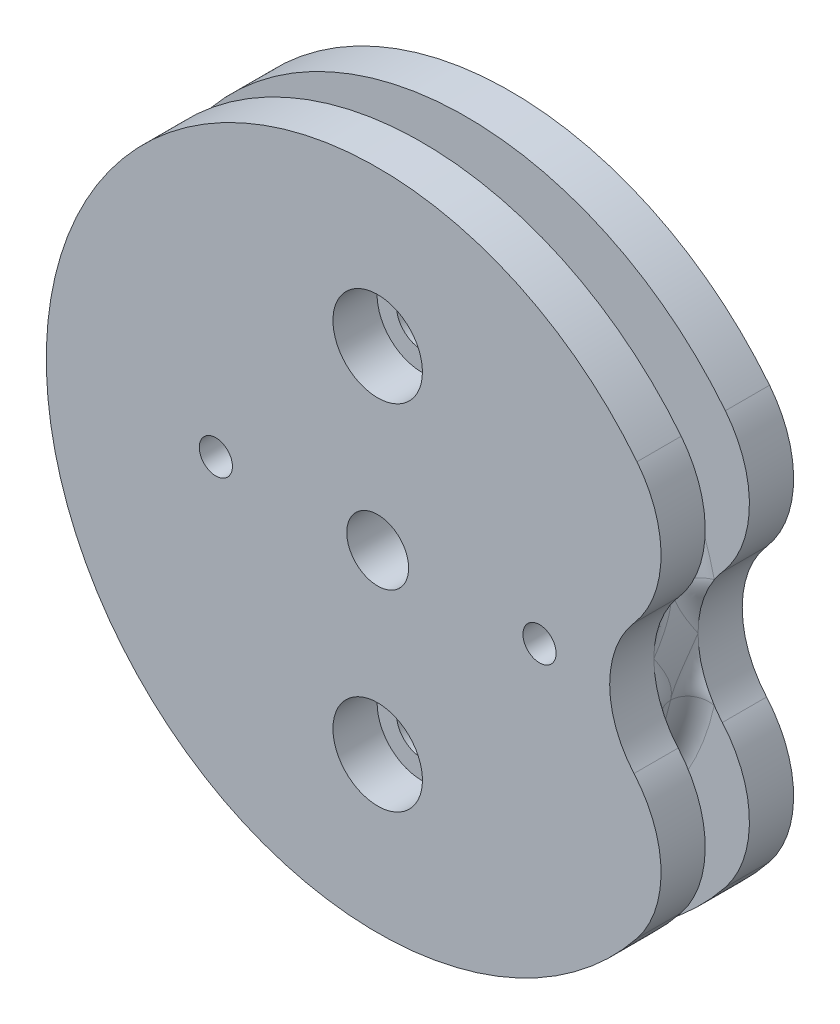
ISO-10303-21;
HEADER;
FILE_DESCRIPTION(('STEP AP214'),'2;1');
FILE_NAME('part.step','',(''),(''),'','','');
FILE_SCHEMA(('AUTOMOTIVE_DESIGN { 1 0 10303 214 1 1 1 1 }'));
ENDSEC;
DATA;
#1=APPLICATION_CONTEXT('core data for automotive mechanical design processes');
#2=APPLICATION_PROTOCOL_DEFINITION('international standard','automotive_design',2000,#1);
#3=PRODUCT_CONTEXT('',#1,'mechanical');
#4=PRODUCT('Part','Part','',(#3));
#5=PRODUCT_RELATED_PRODUCT_CATEGORY('part','',(#4));
#6=PRODUCT_DEFINITION_FORMATION('','',#4);
#7=PRODUCT_DEFINITION_CONTEXT('part definition',#1,'design');
#8=PRODUCT_DEFINITION('design','',#6,#7);
#9=PRODUCT_DEFINITION_SHAPE('','',#8);
#10=(LENGTH_UNIT() NAMED_UNIT(*) SI_UNIT(.MILLI.,.METRE.));
#11=(NAMED_UNIT(*) PLANE_ANGLE_UNIT() SI_UNIT($,.RADIAN.));
#12=(NAMED_UNIT(*) SI_UNIT($,.STERADIAN.) SOLID_ANGLE_UNIT());
#13=UNCERTAINTY_MEASURE_WITH_UNIT(LENGTH_MEASURE(1.E-05),#10,'distance_accuracy_value','');
#14=(GEOMETRIC_REPRESENTATION_CONTEXT(3) GLOBAL_UNCERTAINTY_ASSIGNED_CONTEXT((#13)) GLOBAL_UNIT_ASSIGNED_CONTEXT((#10,
#11,#12)) REPRESENTATION_CONTEXT('',''));
#15=CARTESIAN_POINT('',(0.,0.,0.));
#16=DIRECTION('',(0.,0.,1.));
#17=DIRECTION('',(1.,0.,0.));
#18=AXIS2_PLACEMENT_3D('',#15,#16,#17);
#19=CARTESIAN_POINT('',(0.,0.,3.));
#20=DIRECTION('',(0.,0.,-1.));
#21=DIRECTION('',(-1.,0.,0.));
#22=AXIS2_PLACEMENT_3D('',#19,#20,#21);
#23=CYLINDRICAL_SURFACE('',#22,15.);
#24=CARTESIAN_POINT('',(0.,0.,-1.));
#25=DIRECTION('',(0.,0.,1.));
#26=DIRECTION('',(1.,0.,0.));
#27=AXIS2_PLACEMENT_3D('',#24,#25,#26);
#28=CIRCLE('',#27,15.);
#29=CARTESIAN_POINT('',(11.7375,9.33975876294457,-1.));
#30=VERTEX_POINT('',#29);
#31=CARTESIAN_POINT('',(11.7375,-9.33975876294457,-1.));
#32=VERTEX_POINT('',#31);
#33=EDGE_CURVE('E236',#30,#32,#28,.T.);
#34=ORIENTED_EDGE('',*,*,#33,.F.);
#35=DIRECTION('',(0.,0.,-1.));
#36=VECTOR('',#35,1.);
#37=CARTESIAN_POINT('',(11.7375,9.33975876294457,3.));
#38=LINE('',#37,#36);
#39=CARTESIAN_POINT('',(11.7375,9.33975876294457,-3.));
#40=VERTEX_POINT('',#39);
#41=EDGE_CURVE('E448',#30,#40,#38,.T.);
#42=ORIENTED_EDGE('',*,*,#41,.T.);
#43=CARTESIAN_POINT('',(0.,0.,-3.));
#44=DIRECTION('',(0.,0.,1.));
#45=DIRECTION('',(1.,0.,0.));
#46=AXIS2_PLACEMENT_3D('',#43,#44,#45);
#47=CIRCLE('',#46,15.);
#48=CARTESIAN_POINT('',(11.7375,-9.33975876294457,-3.));
#49=VERTEX_POINT('',#48);
#50=EDGE_CURVE('E213',#40,#49,#47,.T.);
#51=ORIENTED_EDGE('',*,*,#50,.T.);
#52=DIRECTION('',(0.,0.,-1.));
#53=VECTOR('',#52,1.);
#54=CARTESIAN_POINT('',(11.7375,-9.33975876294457,3.));
#55=LINE('',#54,#53);
#56=EDGE_CURVE('E445',#49,#32,#55,.F.);
#57=ORIENTED_EDGE('',*,*,#56,.T.);
#58=EDGE_LOOP('',(#34,#42,#51,#57));
#59=FACE_BOUND('',#58,.T.);
#60=ADVANCED_FACE('F37',(#59),#23,.T.);
#61=CARTESIAN_POINT('',(0.,0.,3.));
#62=DIRECTION('',(0.,0.,-1.));
#63=DIRECTION('',(-1.,0.,0.));
#64=AXIS2_PLACEMENT_3D('',#61,#62,#63);
#65=CYLINDRICAL_SURFACE('',#64,4.15);
#66=CARTESIAN_POINT('',(0.,0.,-3.));
#67=DIRECTION('',(0.,0.,1.));
#68=DIRECTION('',(1.,0.,0.));
#69=AXIS2_PLACEMENT_3D('',#66,#67,#68);
#70=CIRCLE('',#69,4.15);
#71=CARTESIAN_POINT('',(4.15,0.,-3.));
#72=VERTEX_POINT('',#71);
#73=EDGE_CURVE('E217',#72,#72,#70,.T.);
#74=ORIENTED_EDGE('',*,*,#73,.F.);
#75=EDGE_LOOP('',(#74));
#76=FACE_BOUND('',#75,.T.);
#77=CARTESIAN_POINT('',(0.,0.,-0.150000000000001));
#78=DIRECTION('',(0.,0.,1.));
#79=DIRECTION('',(1.,0.,0.));
#80=AXIS2_PLACEMENT_3D('',#77,#78,#79);
#81=CIRCLE('',#80,4.15);
#82=CARTESIAN_POINT('',(4.15,0.,-0.150000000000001));
#83=VERTEX_POINT('',#82);
#84=EDGE_CURVE('E241',#83,#83,#81,.F.);
#85=ORIENTED_EDGE('',*,*,#84,.F.);
#86=EDGE_LOOP('',(#85));
#87=FACE_BOUND('',#86,.T.);
#88=ADVANCED_FACE('F404',(#76,#87),#65,.F.);
#89=CARTESIAN_POINT('',(0.,0.,3.));
#90=DIRECTION('',(0.,0.,1.));
#91=DIRECTION('',(1.,0.,0.));
#92=AXIS2_PLACEMENT_3D('',#89,#90,#91);
#93=PLANE('',#92);
#94=CARTESIAN_POINT('',(-7.325,0.,3.));
#95=DIRECTION('',(0.,0.,-1.));
#96=DIRECTION('',(1.,0.,0.));
#97=AXIS2_PLACEMENT_3D('',#94,#95,#96);
#98=CIRCLE('',#97,0.749999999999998);
#99=CARTESIAN_POINT('',(-6.575,0.,3.));
#100=VERTEX_POINT('',#99);
#101=EDGE_CURVE('E184',#100,#100,#98,.T.);
#102=ORIENTED_EDGE('',*,*,#101,.T.);
#103=EDGE_LOOP('',(#102));
#104=FACE_BOUND('',#103,.T.);
#105=CARTESIAN_POINT('',(7.325,0.,3.));
#106=DIRECTION('',(0.,0.,-1.));
#107=DIRECTION('',(-1.,0.,0.));
#108=AXIS2_PLACEMENT_3D('',#105,#106,#107);
#109=CIRCLE('',#108,0.749999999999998);
#110=CARTESIAN_POINT('',(6.575,0.,3.));
#111=VERTEX_POINT('',#110);
#112=EDGE_CURVE('E183',#111,#111,#109,.T.);
#113=ORIENTED_EDGE('',*,*,#112,.T.);
#114=EDGE_LOOP('',(#113));
#115=FACE_BOUND('',#114,.T.);
#116=CARTESIAN_POINT('',(15.,0.,3.));
#117=DIRECTION('',(0.,0.,1.));
#118=DIRECTION('',(1.,0.,0.));
#119=AXIS2_PLACEMENT_3D('',#116,#117,#118);
#120=CIRCLE('',#119,4.5);
#121=CARTESIAN_POINT('',(11.6013157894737,2.94939750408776,3.));
#122=VERTEX_POINT('',#121);
#123=CARTESIAN_POINT('',(11.6013157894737,-2.94939750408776,3.));
#124=VERTEX_POINT('',#123);
#125=EDGE_CURVE('E173',#122,#124,#120,.T.);
#126=ORIENTED_EDGE('',*,*,#125,.F.);
#127=CARTESIAN_POINT('',(7.825,6.22650584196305,3.));
#128=DIRECTION('',(0.,0.,1.));
#129=DIRECTION('',(1.,0.,0.));
#130=AXIS2_PLACEMENT_3D('',#127,#128,#129);
#131=CIRCLE('',#130,5.);
#132=CARTESIAN_POINT('',(11.7375,9.33975876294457,3.));
#133=VERTEX_POINT('',#132);
#134=EDGE_CURVE('E431',#122,#133,#131,.T.);
#135=ORIENTED_EDGE('',*,*,#134,.T.);
#136=CARTESIAN_POINT('',(0.,0.,3.));
#137=DIRECTION('',(0.,0.,1.));
#138=DIRECTION('',(1.,0.,0.));
#139=AXIS2_PLACEMENT_3D('',#136,#137,#138);
#140=CIRCLE('',#139,15.);
#141=CARTESIAN_POINT('',(11.7375,-9.33975876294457,3.));
#142=VERTEX_POINT('',#141);
#143=EDGE_CURVE('E256',#133,#142,#140,.T.);
#144=ORIENTED_EDGE('',*,*,#143,.T.);
#145=CARTESIAN_POINT('',(7.825,-6.22650584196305,3.));
#146=DIRECTION('',(0.,0.,1.));
#147=DIRECTION('',(1.,0.,0.));
#148=AXIS2_PLACEMENT_3D('',#145,#146,#147);
#149=CIRCLE('',#148,5.);
#150=EDGE_CURVE('E442',#142,#124,#149,.T.);
#151=ORIENTED_EDGE('',*,*,#150,.T.);
#152=EDGE_LOOP('',(#126,#135,#144,#151));
#153=FACE_BOUND('',#152,.T.);
#154=CARTESIAN_POINT('',(0.,8.,3.));
#155=DIRECTION('',(0.,0.,1.));
#156=DIRECTION('',(1.,0.,0.));
#157=AXIS2_PLACEMENT_3D('',#154,#155,#156);
#158=CIRCLE('',#157,2.025);
#159=CARTESIAN_POINT('',(2.025,8.,3.));
#160=VERTEX_POINT('',#159);
#161=EDGE_CURVE('E252',#160,#160,#158,.T.);
#162=ORIENTED_EDGE('',*,*,#161,.F.);
#163=EDGE_LOOP('',(#162));
#164=FACE_BOUND('',#163,.T.);
#165=CARTESIAN_POINT('',(0.,-8.,3.));
#166=DIRECTION('',(0.,0.,1.));
#167=DIRECTION('',(-1.,0.,0.));
#168=AXIS2_PLACEMENT_3D('',#165,#166,#167);
#169=CIRCLE('',#168,2.025);
#170=CARTESIAN_POINT('',(-2.025,-8.,3.));
#171=VERTEX_POINT('',#170);
#172=EDGE_CURVE('E244',#171,#171,#169,.T.);
#173=ORIENTED_EDGE('',*,*,#172,.F.);
#174=EDGE_LOOP('',(#173));
#175=FACE_BOUND('',#174,.T.);
#176=CARTESIAN_POINT('',(0.,0.,3.));
#177=DIRECTION('',(0.,0.,1.));
#178=DIRECTION('',(1.,0.,0.));
#179=AXIS2_PLACEMENT_3D('',#176,#177,#178);
#180=CIRCLE('',#179,1.4);
#181=CARTESIAN_POINT('',(1.4,0.,3.));
#182=VERTEX_POINT('',#181);
#183=EDGE_CURVE('E238',#182,#182,#180,.T.);
#184=ORIENTED_EDGE('',*,*,#183,.F.);
#185=EDGE_LOOP('',(#184));
#186=FACE_BOUND('',#185,.T.);
#187=ADVANCED_FACE('F193',(#104,#115,#153,#164,#175,#186),#93,.T.);
#188=CARTESIAN_POINT('',(0.,0.,-3.));
#189=DIRECTION('',(0.,0.,1.));
#190=DIRECTION('',(1.,0.,0.));
#191=AXIS2_PLACEMENT_3D('',#188,#189,#190);
#192=PLANE('',#191);
#193=CARTESIAN_POINT('',(-7.325,0.,-3.));
#194=DIRECTION('',(0.,0.,-1.));
#195=DIRECTION('',(1.,0.,0.));
#196=AXIS2_PLACEMENT_3D('',#193,#194,#195);
#197=CIRCLE('',#196,0.749999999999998);
#198=CARTESIAN_POINT('',(-6.575,0.,-3.));
#199=VERTEX_POINT('',#198);
#200=EDGE_CURVE('E187',#199,#199,#197,.T.);
#201=ORIENTED_EDGE('',*,*,#200,.F.);
#202=EDGE_LOOP('',(#201));
#203=FACE_BOUND('',#202,.T.);
#204=CARTESIAN_POINT('',(7.325,0.,-3.));
#205=DIRECTION('',(0.,0.,-1.));
#206=DIRECTION('',(-1.,0.,0.));
#207=AXIS2_PLACEMENT_3D('',#204,#205,#206);
#208=CIRCLE('',#207,0.749999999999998);
#209=CARTESIAN_POINT('',(6.575,0.,-3.));
#210=VERTEX_POINT('',#209);
#211=EDGE_CURVE('E180',#210,#210,#208,.T.);
#212=ORIENTED_EDGE('',*,*,#211,.F.);
#213=EDGE_LOOP('',(#212));
#214=FACE_BOUND('',#213,.T.);
#215=ORIENTED_EDGE('',*,*,#50,.F.);
#216=CARTESIAN_POINT('',(7.825,6.22650584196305,-3.));
#217=DIRECTION('',(0.,0.,1.));
#218=DIRECTION('',(1.,0.,0.));
#219=AXIS2_PLACEMENT_3D('',#216,#217,#218);
#220=CIRCLE('',#219,5.);
#221=CARTESIAN_POINT('',(11.6013157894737,2.94939750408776,-3.));
#222=VERTEX_POINT('',#221);
#223=EDGE_CURVE('E453',#40,#222,#220,.F.);
#224=ORIENTED_EDGE('',*,*,#223,.T.);
#225=CARTESIAN_POINT('',(15.,0.,-3.));
#226=DIRECTION('',(0.,0.,1.));
#227=DIRECTION('',(1.,0.,0.));
#228=AXIS2_PLACEMENT_3D('',#225,#226,#227);
#229=CIRCLE('',#228,4.5);
#230=CARTESIAN_POINT('',(11.6013157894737,-2.94939750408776,-3.));
#231=VERTEX_POINT('',#230);
#232=EDGE_CURVE('E169',#222,#231,#229,.T.);
#233=ORIENTED_EDGE('',*,*,#232,.T.);
#234=CARTESIAN_POINT('',(7.825,-6.22650584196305,-3.));
#235=DIRECTION('',(0.,0.,1.));
#236=DIRECTION('',(1.,0.,0.));
#237=AXIS2_PLACEMENT_3D('',#234,#235,#236);
#238=CIRCLE('',#237,5.);
#239=EDGE_CURVE('E451',#231,#49,#238,.F.);
#240=ORIENTED_EDGE('',*,*,#239,.T.);
#241=EDGE_LOOP('',(#215,#224,#233,#240));
#242=FACE_BOUND('',#241,.T.);
#243=ORIENTED_EDGE('',*,*,#73,.T.);
#244=EDGE_LOOP('',(#243));
#245=FACE_BOUND('',#244,.T.);
#246=CARTESIAN_POINT('',(0.,-8.,-3.));
#247=DIRECTION('',(0.,0.,-1.));
#248=DIRECTION('',(1.,0.,0.));
#249=AXIS2_PLACEMENT_3D('',#246,#247,#248);
#250=CIRCLE('',#249,1.15);
#251=CARTESIAN_POINT('',(1.15,-8.,-3.));
#252=VERTEX_POINT('',#251);
#253=EDGE_CURVE('E221',#252,#252,#250,.T.);
#254=ORIENTED_EDGE('',*,*,#253,.F.);
#255=EDGE_LOOP('',(#254));
#256=FACE_BOUND('',#255,.T.);
#257=CARTESIAN_POINT('',(0.,8.,-3.));
#258=DIRECTION('',(0.,0.,-1.));
#259=DIRECTION('',(-1.,0.,0.));
#260=AXIS2_PLACEMENT_3D('',#257,#258,#259);
#261=CIRCLE('',#260,1.15);
#262=CARTESIAN_POINT('',(-1.15,8.,-3.));
#263=VERTEX_POINT('',#262);
#264=EDGE_CURVE('E224',#263,#263,#261,.T.);
#265=ORIENTED_EDGE('',*,*,#264,.F.);
#266=EDGE_LOOP('',(#265));
#267=FACE_BOUND('',#266,.T.);
#268=ADVANCED_FACE('F204',(#203,#214,#242,#245,#256,#267),#192,.F.);
#269=ORIENTED_EDGE('',*,*,#143,.F.);
#270=DIRECTION('',(0.,0.,-1.));
#271=VECTOR('',#270,1.);
#272=CARTESIAN_POINT('',(11.7375,9.33975876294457,3.));
#273=LINE('',#272,#271);
#274=CARTESIAN_POINT('',(11.7375,9.33975876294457,1.));
#275=VERTEX_POINT('',#274);
#276=EDGE_CURVE('E425',#133,#275,#273,.T.);
#277=ORIENTED_EDGE('',*,*,#276,.T.);
#278=CARTESIAN_POINT('',(0.,0.,1.));
#279=DIRECTION('',(0.,0.,1.));
#280=DIRECTION('',(1.,0.,0.));
#281=AXIS2_PLACEMENT_3D('',#278,#279,#280);
#282=CIRCLE('',#281,15.);
#283=CARTESIAN_POINT('',(11.7375,-9.33975876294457,1.));
#284=VERTEX_POINT('',#283);
#285=EDGE_CURVE('E235',#275,#284,#282,.T.);
#286=ORIENTED_EDGE('',*,*,#285,.T.);
#287=DIRECTION('',(0.,0.,-1.));
#288=VECTOR('',#287,1.);
#289=CARTESIAN_POINT('',(11.7375,-9.33975876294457,3.));
#290=LINE('',#289,#288);
#291=EDGE_CURVE('E334',#284,#142,#290,.F.);
#292=ORIENTED_EDGE('',*,*,#291,.T.);
#293=EDGE_LOOP('',(#269,#277,#286,#292));
#294=FACE_BOUND('',#293,.T.);
#295=ADVANCED_FACE('F207',(#294),#23,.T.);
#296=CARTESIAN_POINT('',(0.,8.,3.));
#297=DIRECTION('',(0.,0.,-1.));
#298=DIRECTION('',(-1.,0.,0.));
#299=AXIS2_PLACEMENT_3D('',#296,#297,#298);
#300=CYLINDRICAL_SURFACE('',#299,2.025);
#301=CARTESIAN_POINT('',(0.,8.,1.));
#302=DIRECTION('',(0.,0.,1.));
#303=DIRECTION('',(1.,0.,0.));
#304=AXIS2_PLACEMENT_3D('',#301,#302,#303);
#305=CIRCLE('',#304,2.025);
#306=CARTESIAN_POINT('',(2.025,8.,1.));
#307=VERTEX_POINT('',#306);
#308=EDGE_CURVE('E263',#307,#307,#305,.T.);
#309=ORIENTED_EDGE('',*,*,#308,.F.);
#310=EDGE_LOOP('',(#309));
#311=FACE_BOUND('',#310,.T.);
#312=ORIENTED_EDGE('',*,*,#161,.T.);
#313=EDGE_LOOP('',(#312));
#314=FACE_BOUND('',#313,.T.);
#315=ADVANCED_FACE('F413',(#311,#314),#300,.F.);
#316=CARTESIAN_POINT('',(0.,-8.,3.));
#317=DIRECTION('',(0.,0.,-1.));
#318=DIRECTION('',(-1.,0.,0.));
#319=AXIS2_PLACEMENT_3D('',#316,#317,#318);
#320=CYLINDRICAL_SURFACE('',#319,2.025);
#321=CARTESIAN_POINT('',(0.,-8.,1.));
#322=DIRECTION('',(0.,0.,1.));
#323=DIRECTION('',(1.,0.,0.));
#324=AXIS2_PLACEMENT_3D('',#321,#322,#323);
#325=CIRCLE('',#324,2.025);
#326=CARTESIAN_POINT('',(2.025,-8.,1.));
#327=VERTEX_POINT('',#326);
#328=EDGE_CURVE('E259',#327,#327,#325,.T.);
#329=ORIENTED_EDGE('',*,*,#328,.F.);
#330=EDGE_LOOP('',(#329));
#331=FACE_BOUND('',#330,.T.);
#332=ORIENTED_EDGE('',*,*,#172,.T.);
#333=EDGE_LOOP('',(#332));
#334=FACE_BOUND('',#333,.T.);
#335=ADVANCED_FACE('F418',(#331,#334),#320,.F.);
#336=CARTESIAN_POINT('',(0.,0.,-14.7379725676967));
#337=DIRECTION('',(0.,0.,1.));
#338=DIRECTION('',(1.,0.,0.));
#339=AXIS2_PLACEMENT_3D('',#336,#337,#338);
#340=CYLINDRICAL_SURFACE('',#339,1.4);
#341=CARTESIAN_POINT('',(0.,0.,-0.150000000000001));
#342=DIRECTION('',(0.,0.,1.));
#343=DIRECTION('',(1.,0.,0.));
#344=AXIS2_PLACEMENT_3D('',#341,#342,#343);
#345=CIRCLE('',#344,1.4);
#346=CARTESIAN_POINT('',(1.4,0.,-0.150000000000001));
#347=VERTEX_POINT('',#346);
#348=EDGE_CURVE('E245',#347,#347,#345,.F.);
#349=ORIENTED_EDGE('',*,*,#348,.T.);
#350=EDGE_LOOP('',(#349));
#351=FACE_BOUND('',#350,.T.);
#352=ORIENTED_EDGE('',*,*,#183,.T.);
#353=EDGE_LOOP('',(#352));
#354=FACE_BOUND('',#353,.T.);
#355=ADVANCED_FACE('F490',(#351,#354),#340,.F.);
#356=CARTESIAN_POINT('',(0.,0.,-0.15));
#357=DIRECTION('',(0.,0.,1.));
#358=DIRECTION('',(1.,0.,0.));
#359=AXIS2_PLACEMENT_3D('',#356,#357,#358);
#360=PLANE('',#359);
#361=ORIENTED_EDGE('',*,*,#84,.T.);
#362=EDGE_LOOP('',(#361));
#363=FACE_BOUND('',#362,.T.);
#364=ORIENTED_EDGE('',*,*,#348,.F.);
#365=EDGE_LOOP('',(#364));
#366=FACE_BOUND('',#365,.T.);
#367=ADVANCED_FACE('F492',(#363,#366),#360,.F.);
#368=CARTESIAN_POINT('',(0.,0.,-1.));
#369=DIRECTION('',(0.,0.,1.));
#370=DIRECTION('',(1.,0.,0.));
#371=AXIS2_PLACEMENT_3D('',#368,#369,#370);
#372=PLANE('',#371);
#373=CARTESIAN_POINT('',(15.,0.,-1.));
#374=DIRECTION('',(0.,0.,1.));
#375=DIRECTION('',(1.,0.,0.));
#376=AXIS2_PLACEMENT_3D('',#373,#374,#375);
#377=CIRCLE('',#376,4.5);
#378=CARTESIAN_POINT('',(11.6013157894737,2.94939750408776,-1.));
#379=VERTEX_POINT('',#378);
#380=CARTESIAN_POINT('',(11.2333333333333,2.46215804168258,-1.));
#381=VERTEX_POINT('',#380);
#382=EDGE_CURVE('E167',#379,#381,#377,.T.);
#383=ORIENTED_EDGE('',*,*,#382,.F.);
#384=CARTESIAN_POINT('',(7.825,6.22650584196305,-1.));
#385=DIRECTION('',(0.,0.,1.));
#386=DIRECTION('',(1.,0.,0.));
#387=AXIS2_PLACEMENT_3D('',#384,#385,#386);
#388=CIRCLE('',#387,5.);
#389=EDGE_CURVE('E12',#379,#30,#388,.T.);
#390=ORIENTED_EDGE('',*,*,#389,.T.);
#391=ORIENTED_EDGE('',*,*,#33,.T.);
#392=CARTESIAN_POINT('',(7.825,-6.22650584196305,-1.));
#393=DIRECTION('',(0.,0.,1.));
#394=DIRECTION('',(1.,0.,0.));
#395=AXIS2_PLACEMENT_3D('',#392,#393,#394);
#396=CIRCLE('',#395,5.);
#397=CARTESIAN_POINT('',(11.6013157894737,-2.94939750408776,-1.));
#398=VERTEX_POINT('',#397);
#399=EDGE_CURVE('E45',#32,#398,#396,.T.);
#400=ORIENTED_EDGE('',*,*,#399,.T.);
#401=CARTESIAN_POINT('',(11.2333333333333,-2.46215804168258,-1.));
#402=VERTEX_POINT('',#401);
#403=EDGE_CURVE('E152',#402,#398,#377,.T.);
#404=ORIENTED_EDGE('',*,*,#403,.F.);
#405=CARTESIAN_POINT('',(0.,0.,-1.));
#406=DIRECTION('',(0.,0.,1.));
#407=DIRECTION('',(1.,0.,0.));
#408=AXIS2_PLACEMENT_3D('',#405,#406,#407);
#409=CIRCLE('',#408,11.5);
#410=EDGE_CURVE('E158',#402,#381,#409,.F.);
#411=ORIENTED_EDGE('',*,*,#410,.T.);
#412=EDGE_LOOP('',(#383,#390,#391,#400,#404,#411));
#413=FACE_BOUND('',#412,.T.);
#414=ADVANCED_FACE('F290',(#413),#372,.T.);
#415=CARTESIAN_POINT('',(0.,0.,1.));
#416=DIRECTION('',(0.,0.,1.));
#417=DIRECTION('',(1.,0.,0.));
#418=AXIS2_PLACEMENT_3D('',#415,#416,#417);
#419=PLANE('',#418);
#420=ORIENTED_EDGE('',*,*,#285,.F.);
#421=CARTESIAN_POINT('',(7.825,6.22650584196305,1.));
#422=DIRECTION('',(0.,0.,1.));
#423=DIRECTION('',(1.,0.,0.));
#424=AXIS2_PLACEMENT_3D('',#421,#422,#423);
#425=CIRCLE('',#424,5.);
#426=CARTESIAN_POINT('',(11.6013157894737,2.94939750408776,1.));
#427=VERTEX_POINT('',#426);
#428=EDGE_CURVE('E432',#275,#427,#425,.F.);
#429=ORIENTED_EDGE('',*,*,#428,.T.);
#430=CARTESIAN_POINT('',(15.,0.,1.));
#431=DIRECTION('',(0.,0.,1.));
#432=DIRECTION('',(1.,0.,0.));
#433=AXIS2_PLACEMENT_3D('',#430,#431,#432);
#434=CIRCLE('',#433,4.5);
#435=CARTESIAN_POINT('',(11.2333333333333,2.46215804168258,1.));
#436=VERTEX_POINT('',#435);
#437=EDGE_CURVE('E154',#427,#436,#434,.T.);
#438=ORIENTED_EDGE('',*,*,#437,.T.);
#439=CARTESIAN_POINT('',(0.,0.,1.));
#440=DIRECTION('',(0.,0.,1.));
#441=DIRECTION('',(1.,0.,0.));
#442=AXIS2_PLACEMENT_3D('',#439,#440,#441);
#443=CIRCLE('',#442,11.5);
#444=CARTESIAN_POINT('',(11.2333333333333,-2.46215804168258,1.));
#445=VERTEX_POINT('',#444);
#446=EDGE_CURVE('E266',#436,#445,#443,.T.);
#447=ORIENTED_EDGE('',*,*,#446,.T.);
#448=CARTESIAN_POINT('',(11.6013157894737,-2.94939750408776,1.));
#449=VERTEX_POINT('',#448);
#450=EDGE_CURVE('E148',#445,#449,#434,.T.);
#451=ORIENTED_EDGE('',*,*,#450,.T.);
#452=CARTESIAN_POINT('',(7.825,-6.22650584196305,1.));
#453=DIRECTION('',(0.,0.,1.));
#454=DIRECTION('',(1.,0.,0.));
#455=AXIS2_PLACEMENT_3D('',#452,#453,#454);
#456=CIRCLE('',#455,5.);
#457=EDGE_CURVE('E433',#449,#284,#456,.F.);
#458=ORIENTED_EDGE('',*,*,#457,.T.);
#459=EDGE_LOOP('',(#420,#429,#438,#447,#451,#458));
#460=FACE_BOUND('',#459,.T.);
#461=ADVANCED_FACE('F287',(#460),#419,.F.);
#462=CARTESIAN_POINT('',(0.,0.,-1.));
#463=DIRECTION('',(0.,0.,1.));
#464=DIRECTION('',(1.,0.,0.));
#465=AXIS2_PLACEMENT_3D('',#462,#463,#464);
#466=CYLINDRICAL_SURFACE('',#465,10.5);
#467=CARTESIAN_POINT('',(10.1460099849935,2.70342031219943,0.0778486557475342));
#468=CARTESIAN_POINT('',(10.249171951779,2.31625064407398,1.28646877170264));
#469=CARTESIAN_POINT('',(11.4200375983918,2.72651227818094,1.));
#470=CARTESIAN_POINT('',(10.1657562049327,2.62943704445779,0.0500836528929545));
#471=CARTESIAN_POINT('',(10.2421797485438,2.33130244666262,1.24017321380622));
#472=CARTESIAN_POINT('',(11.391433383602,2.68895078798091,1.));
#473=CARTESIAN_POINT('',(10.1851422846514,2.55330728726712,0.0304704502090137));
#474=CARTESIAN_POINT('',(10.2402002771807,2.33166318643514,1.18930577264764));
#475=CARTESIAN_POINT('',(11.3609793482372,2.6477413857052,1.));
#476=CARTESIAN_POINT('',(10.2224050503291,2.39967331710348,0.00542892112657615));
#477=CARTESIAN_POINT('',(10.2438823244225,2.30620680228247,1.09041084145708));
#478=CARTESIAN_POINT('',(11.297852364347,2.55872079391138,1.));
#479=CARTESIAN_POINT('',(10.2402968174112,2.32219583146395,-0.000163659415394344));
#480=CARTESIAN_POINT('',(10.2491225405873,2.28185264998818,1.04237978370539));
#481=CARTESIAN_POINT('',(11.2652097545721,2.51099302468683,1.));
#482=CARTESIAN_POINT('',(10.2827554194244,2.12819095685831,0.000255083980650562));
#483=CARTESIAN_POINT('',(10.2678530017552,2.19630751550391,0.935080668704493));
#484=CARTESIAN_POINT('',(11.1817967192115,2.38320783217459,1.));
#485=CARTESIAN_POINT('',(10.3061945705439,2.01148153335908,0.013454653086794));
#486=CARTESIAN_POINT('',(10.2839251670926,2.12375355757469,0.879370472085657));
#487=CARTESIAN_POINT('',(11.1301130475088,2.29890693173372,1.));
#488=CARTESIAN_POINT('',(10.3487120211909,1.7799344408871,0.0590799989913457));
#489=CARTESIAN_POINT('',(10.3188219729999,1.95130908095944,0.794998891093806));
#490=CARTESIAN_POINT('',(11.0267980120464,2.1153831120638,1.));
#491=CARTESIAN_POINT('',(10.3677600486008,1.66511455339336,0.0916340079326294));
#492=CARTESIAN_POINT('',(10.3375960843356,1.85233349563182,0.76482728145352));
#493=CARTESIAN_POINT('',(10.975169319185,2.01606399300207,1.));
#494=CARTESIAN_POINT('',(10.4051025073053,1.41526890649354,0.17889869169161));
#495=CARTESIAN_POINT('',(10.3770612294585,1.61964933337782,0.725187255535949));
#496=CARTESIAN_POINT('',(10.8652907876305,1.78163166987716,1.));
#497=CARTESIAN_POINT('',(10.4223997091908,1.28106013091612,0.236825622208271));
#498=CARTESIAN_POINT('',(10.3978692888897,1.48152898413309,0.719195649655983));
#499=CARTESIAN_POINT('',(10.8079255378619,1.64338097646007,1.));
#500=CARTESIAN_POINT('',(10.4514440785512,1.01734055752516,0.365914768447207));
#501=CARTESIAN_POINT('',(10.4338828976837,1.19819339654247,0.732823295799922));
#502=CARTESIAN_POINT('',(10.7043935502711,1.34982345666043,1.));
#503=CARTESIAN_POINT('',(10.4631799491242,0.887839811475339,0.437103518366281));
#504=CARTESIAN_POINT('',(10.449523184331,1.05159939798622,0.751500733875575));
#505=CARTESIAN_POINT('',(10.6582496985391,1.19448269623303,1.));
#506=CARTESIAN_POINT('',(10.4817288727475,0.632289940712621,0.587485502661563));
#507=CARTESIAN_POINT('',(10.4743843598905,0.757198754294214,0.804471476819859));
#508=CARTESIAN_POINT('',(10.5820059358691,0.871159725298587,1.));
#509=CARTESIAN_POINT('',(10.4885357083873,0.506245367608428,0.666688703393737));
#510=CARTESIAN_POINT('',(10.4839406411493,0.607502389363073,0.838689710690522));
#511=CARTESIAN_POINT('',(10.5519263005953,0.703161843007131,1.));
#512=CARTESIAN_POINT('',(10.4976205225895,0.256149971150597,0.828787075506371));
#513=CARTESIAN_POINT('',(10.4965863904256,0.309482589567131,0.91416358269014));
#514=CARTESIAN_POINT('',(10.5111592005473,0.360585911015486,1.));
#515=CARTESIAN_POINT('',(10.4999017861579,0.132097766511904,0.911679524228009));
#516=CARTESIAN_POINT('',(10.499860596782,0.159078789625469,0.955834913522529));
#517=CARTESIAN_POINT('',(10.500457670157,0.186012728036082,1.));
#518=CARTESIAN_POINT('',(10.4999989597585,0.00538249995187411,0.996401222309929));
#519=CARTESIAN_POINT('',(10.4999985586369,0.00648097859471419,0.998200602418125));
#520=CARTESIAN_POINT('',(10.500004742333,0.00757944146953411,1.));
#521=CARTESIAN_POINT('',(10.4999999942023,0.00269124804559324,0.998200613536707));
#522=CARTESIAN_POINT('',(10.500000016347,0.00324048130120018,0.999100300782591));
#523=CARTESIAN_POINT('',(10.4999999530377,0.00378972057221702,1.));
#524=CARTESIAN_POINT('',(10.5,0.,1.));
#525=CARTESIAN_POINT('',(10.5,0.,1.));
#526=CARTESIAN_POINT('',(10.5,1.62525146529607E-12,1.));
#527=(BOUNDED_SURFACE() B_SPLINE_SURFACE(3,2,((#467,#468,#469),(#470,#471,#472),(#473,#474,
#475),(#476,#477,#478),(#479,#480,#481),(#482,#483,#484),(#485,#486,#487),(#488,#489,#490),
(#491,#492,#493),(#494,#495,#496),(#497,#498,#499),(#500,#501,#502),(#503,#504,#505),(#506,#507,
#508),(#509,#510,#511),(#512,#513,#514),(#515,#516,#517),(#518,#519,#520),(#521,#522,#523),
(#524,#525,#526)),.UNSPECIFIED.,.F.,.F.,.F.) B_SPLINE_SURFACE_WITH_KNOTS((4,2,2,2,2,2,2,2,2,4),
(3,3),(0.,0.263885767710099,0.524665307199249,0.915654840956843,1.30926419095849,
1.78548455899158,2.26266818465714,2.74045267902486,3.21789023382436,3.22825041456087),(0.,1.),
.UNSPECIFIED.) GEOMETRIC_REPRESENTATION_ITEM() RATIONAL_B_SPLINE_SURFACE(((1.,0.617648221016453,
1.),(1.,0.631867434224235,1.),(1.,0.646760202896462,1.),(1.,0.67703879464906,1.),(1.,
0.692416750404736,1.),(1.,0.730857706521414,1.),(1.,0.753924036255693,1.),(1.,0.798564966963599,
1.),(1.,0.82012853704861,1.),(1.,0.86472874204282,1.),(1.,0.887124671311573,1.),(1.,
0.92652239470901,1.),(1.,0.943513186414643,1.),(1.,0.971151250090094,1.),(1.,0.981790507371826,
1.),(1.,0.996132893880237,1.),(1.,0.999841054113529,1.),(1.,0.999998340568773,1.),(1.,
1.00000000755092,1.),(1.,1.,1.))) REPRESENTATION_ITEM('') SURFACE());
#528=CARTESIAN_POINT('',(10.1460099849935,2.70342031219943,0.0778486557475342));
#529=CARTESIAN_POINT('',(10.1657562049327,2.62943704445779,0.0500836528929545));
#530=CARTESIAN_POINT('',(10.1851422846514,2.55330728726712,0.0304704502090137));
#531=CARTESIAN_POINT('',(10.2224050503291,2.39967331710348,0.00542892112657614));
#532=CARTESIAN_POINT('',(10.2402968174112,2.32219583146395,-0.000163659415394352));
#533=CARTESIAN_POINT('',(10.2827554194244,2.12819095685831,0.000255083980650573));
#534=CARTESIAN_POINT('',(10.3061945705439,2.01148153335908,0.013454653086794));
#535=CARTESIAN_POINT('',(10.3487120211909,1.7799344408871,0.0590799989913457));
#536=CARTESIAN_POINT('',(10.3677600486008,1.66511455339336,0.0916340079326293));
#537=CARTESIAN_POINT('',(10.4051025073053,1.41526890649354,0.17889869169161));
#538=CARTESIAN_POINT('',(10.4223997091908,1.28106013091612,0.236825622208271));
#539=CARTESIAN_POINT('',(10.4514440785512,1.01734055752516,0.365914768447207));
#540=CARTESIAN_POINT('',(10.4631799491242,0.887839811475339,0.437103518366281));
#541=CARTESIAN_POINT('',(10.4817288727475,0.632289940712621,0.587485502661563));
#542=CARTESIAN_POINT('',(10.4885357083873,0.50624536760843,0.666688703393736));
#543=CARTESIAN_POINT('',(10.4976205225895,0.256149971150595,0.828787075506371));
#544=CARTESIAN_POINT('',(10.4999017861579,0.1320977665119,0.911679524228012));
#545=CARTESIAN_POINT('',(10.4999989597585,0.00538249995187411,0.996401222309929));
#546=CARTESIAN_POINT('',(10.4999999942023,0.00269124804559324,0.998200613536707));
#547=CARTESIAN_POINT('',(10.5,0.,1.));
#548=B_SPLINE_CURVE_WITH_KNOTS('',3,(#528,#529,#530,#531,#532,#533,#534,#535,#536,#537,#538,
#539,#540,#541,#542,#543,#544,#545,#546,#547),.UNSPECIFIED.,.F.,.F.,(4,2,2,2,2,2,2,2,2,4),(0.,
0.263885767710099,0.524665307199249,0.915654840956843,1.30926419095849,1.78548455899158,
2.26266818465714,2.74045267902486,3.21789023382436,3.22825041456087),.UNSPECIFIED.);
#549=CARTESIAN_POINT('',(10.2565217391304,2.24805734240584,0.));
#550=VERTEX_POINT('',#549);
#551=CARTESIAN_POINT('',(10.5,0.,1.));
#552=VERTEX_POINT('',#551);
#553=EDGE_CURVE('E124',#550,#552,#548,.T.);
#554=ORIENTED_EDGE('',*,*,#553,.T.);
#555=CARTESIAN_POINT('',(11.4200375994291,-2.72651227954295,1.));
#556=CARTESIAN_POINT('',(10.249171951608,-2.31625064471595,1.28646877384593));
#557=CARTESIAN_POINT('',(10.1460099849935,-2.70342031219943,0.0778486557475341));
#558=CARTESIAN_POINT('',(11.3914333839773,-2.68895078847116,1.));
#559=CARTESIAN_POINT('',(10.2421797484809,-2.331302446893,1.24017321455));
#560=CARTESIAN_POINT('',(10.1657562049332,-2.62943704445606,0.050083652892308));
#561=CARTESIAN_POINT('',(11.360979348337,-2.6477413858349,1.));
#562=CARTESIAN_POINT('',(10.2402002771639,-2.33166318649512,1.18930577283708));
#563=CARTESIAN_POINT('',(10.1851422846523,-2.55330728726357,0.0304704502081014));
#564=CARTESIAN_POINT('',(11.2978523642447,-2.55872079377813,1.));
#565=CARTESIAN_POINT('',(10.2438823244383,-2.30620680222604,1.09041084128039));
#566=CARTESIAN_POINT('',(10.22240505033,-2.39967331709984,0.0054289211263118));
#567=CARTESIAN_POINT('',(11.2652097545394,-2.51099302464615,1.));
#568=CARTESIAN_POINT('',(10.2491225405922,-2.28185264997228,1.04237978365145));
#569=CARTESIAN_POINT('',(10.2402968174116,-2.32219583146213,-0.000163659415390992));
#570=CARTESIAN_POINT('',(11.1817967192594,-2.38320783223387,1.));
#571=CARTESIAN_POINT('',(10.2678530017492,-2.1963075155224,0.935080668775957));
#572=CARTESIAN_POINT('',(10.2827554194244,-2.12819095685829,0.000255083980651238));
#573=CARTESIAN_POINT('',(11.1301130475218,-2.29890693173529,1.));
#574=CARTESIAN_POINT('',(10.2839251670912,-2.12375355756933,0.879370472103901));
#575=CARTESIAN_POINT('',(10.3061945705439,-2.01148153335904,0.0134546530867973));
#576=CARTESIAN_POINT('',(11.026798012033,-2.11538311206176,1.));
#577=CARTESIAN_POINT('',(10.3188219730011,-1.95130908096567,0.79499889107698));
#578=CARTESIAN_POINT('',(10.3487120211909,-1.77993444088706,0.0590799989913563));
#579=CARTESIAN_POINT('',(10.9751693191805,-2.01606399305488,1.));
#580=CARTESIAN_POINT('',(10.337596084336,-1.85233349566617,0.764827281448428));
#581=CARTESIAN_POINT('',(10.3677600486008,-1.66511455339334,0.0916340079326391));
#582=CARTESIAN_POINT('',(10.8652907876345,-1.78163166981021,1.));
#583=CARTESIAN_POINT('',(10.3770612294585,-1.61964933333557,0.725187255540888));
#584=CARTESIAN_POINT('',(10.4051025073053,-1.41526890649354,0.178898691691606));
#585=CARTESIAN_POINT('',(10.807925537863,-1.64338097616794,1.));
#586=CARTESIAN_POINT('',(10.3978692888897,-1.48152898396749,0.719195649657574));
#587=CARTESIAN_POINT('',(10.4223997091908,-1.28106013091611,0.236825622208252));
#588=CARTESIAN_POINT('',(10.7043935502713,-1.34982345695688,1.));
#589=CARTESIAN_POINT('',(10.4338828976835,-1.19819339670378,0.73282329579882));
#590=CARTESIAN_POINT('',(10.4514440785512,-1.01734055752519,0.365914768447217));
#591=CARTESIAN_POINT('',(10.6582496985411,-1.19448269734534,1.));
#592=CARTESIAN_POINT('',(10.4495231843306,-1.05159939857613,0.751500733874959));
#593=CARTESIAN_POINT('',(10.4631799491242,-0.887839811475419,0.437103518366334));
#594=CARTESIAN_POINT('',(10.5820059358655,-0.871159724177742,1.));
#595=CARTESIAN_POINT('',(10.4743843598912,-0.75719875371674,0.804471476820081));
#596=CARTESIAN_POINT('',(10.4817288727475,-0.632289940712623,0.587485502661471));
#597=CARTESIAN_POINT('',(10.5519263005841,-0.703161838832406,1.));
#598=CARTESIAN_POINT('',(10.4839406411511,-0.60750238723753,0.838689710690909));
#599=CARTESIAN_POINT('',(10.4885357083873,-0.506245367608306,0.66668870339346));
#600=CARTESIAN_POINT('',(10.5111592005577,-0.360585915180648,1.));
#601=CARTESIAN_POINT('',(10.496586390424,-0.30948259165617,0.914163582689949));
#602=CARTESIAN_POINT('',(10.4976205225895,-0.256149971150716,0.82878707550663));
#603=CARTESIAN_POINT('',(10.5004576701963,-0.186012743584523,1.));
#604=CARTESIAN_POINT('',(10.499860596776,-0.159078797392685,0.955834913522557));
#605=CARTESIAN_POINT('',(10.4999017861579,-0.13209776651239,0.91167952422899));
#606=CARTESIAN_POINT('',(10.5000047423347,-0.0075794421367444,1.));
#607=CARTESIAN_POINT('',(10.4999985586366,-0.00648097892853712,0.998200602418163));
#608=CARTESIAN_POINT('',(10.4999989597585,-0.00538249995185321,0.99640122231));
#609=CARTESIAN_POINT('',(10.4999999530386,-0.00378972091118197,1.));
#610=CARTESIAN_POINT('',(10.5000000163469,-0.00324048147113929,0.999100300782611));
#611=CARTESIAN_POINT('',(10.4999999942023,-0.00269124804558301,0.998200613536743));
#612=CARTESIAN_POINT('',(10.5,2.12381644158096E-13,1.));
#613=CARTESIAN_POINT('',(10.5,2.12381644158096E-13,1.));
#614=CARTESIAN_POINT('',(10.5,0.,1.));
#615=(BOUNDED_SURFACE() B_SPLINE_SURFACE(3,2,((#555,#556,#557),(#558,#559,#560),(#561,#562,
#563),(#564,#565,#566),(#567,#568,#569),(#570,#571,#572),(#573,#574,#575),(#576,#577,#578),
(#579,#580,#581),(#582,#583,#584),(#585,#586,#587),(#588,#589,#590),(#591,#592,#593),(#594,#595,
#596),(#597,#598,#599),(#600,#601,#602),(#603,#604,#605),(#606,#607,#608),(#609,#610,#611),
(#612,#613,#614)),.UNSPECIFIED.,.F.,.F.,.F.) B_SPLINE_SURFACE_WITH_KNOTS((4,2,2,2,2,2,2,2,2,4),
(3,3),(0.,0.263885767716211,0.524665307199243,0.915654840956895,1.30926419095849,
1.78548455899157,2.26266818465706,2.74045267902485,3.21789023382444,3.22825041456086),(0.,1.),
.UNSPECIFIED.) GEOMETRIC_REPRESENTATION_ITEM() RATIONAL_B_SPLINE_SURFACE(((1.,0.617648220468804,
1.),(1.,0.631867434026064,1.),(1.,0.646760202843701,1.),(1.,0.677038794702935,1.),(1.,
0.692416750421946,1.),(1.,0.730857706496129,1.),(1.,0.753924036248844,1.),(1.,0.798564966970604,
1.),(1.,0.820128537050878,1.),(1.,0.864728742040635,1.),(1.,0.887124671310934,1.),(1.,
0.926522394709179,1.),(1.,0.94351318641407,1.),(1.,0.971151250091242,1.),(1.,0.98179050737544,
1.),(1.,0.99613289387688,1.),(1.,0.999841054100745,1.),(1.,0.999998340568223,1.),(1.,
1.00000000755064,1.),(1.,1.,1.))) REPRESENTATION_ITEM('') SURFACE());
#616=CARTESIAN_POINT('',(10.1460099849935,-2.70342031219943,0.0778486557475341));
#617=CARTESIAN_POINT('',(10.1657562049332,-2.62943704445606,0.050083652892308));
#618=CARTESIAN_POINT('',(10.1851422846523,-2.55330728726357,0.0304704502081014));
#619=CARTESIAN_POINT('',(10.22240505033,-2.39967331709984,0.00542892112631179));
#620=CARTESIAN_POINT('',(10.2402968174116,-2.32219583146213,-0.000163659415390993));
#621=CARTESIAN_POINT('',(10.2827554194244,-2.12819095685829,0.000255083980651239));
#622=CARTESIAN_POINT('',(10.3061945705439,-2.01148153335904,0.0134546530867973));
#623=CARTESIAN_POINT('',(10.3487120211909,-1.77993444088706,0.0590799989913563));
#624=CARTESIAN_POINT('',(10.3677600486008,-1.66511455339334,0.0916340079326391));
#625=CARTESIAN_POINT('',(10.4051025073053,-1.41526890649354,0.178898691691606));
#626=CARTESIAN_POINT('',(10.4223997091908,-1.28106013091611,0.236825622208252));
#627=CARTESIAN_POINT('',(10.4514440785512,-1.01734055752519,0.365914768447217));
#628=CARTESIAN_POINT('',(10.4631799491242,-0.887839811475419,0.437103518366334));
#629=CARTESIAN_POINT('',(10.4817288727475,-0.632289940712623,0.587485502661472));
#630=CARTESIAN_POINT('',(10.4885357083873,-0.506245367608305,0.666688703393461));
#631=CARTESIAN_POINT('',(10.4976205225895,-0.256149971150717,0.82878707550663));
#632=CARTESIAN_POINT('',(10.4999017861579,-0.132097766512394,0.911679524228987));
#633=CARTESIAN_POINT('',(10.4999989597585,-0.00538249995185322,0.99640122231));
#634=CARTESIAN_POINT('',(10.4999999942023,-0.00269124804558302,0.998200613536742));
#635=CARTESIAN_POINT('',(10.5,0.,1.));
#636=B_SPLINE_CURVE_WITH_KNOTS('',3,(#616,#617,#618,#619,#620,#621,#622,#623,#624,#625,#626,
#627,#628,#629,#630,#631,#632,#633,#634,#635),.UNSPECIFIED.,.F.,.F.,(4,2,2,2,2,2,2,2,2,4),(0.,
0.263885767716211,0.524665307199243,0.915654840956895,1.30926419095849,1.78548455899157,
2.26266818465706,2.74045267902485,3.21789023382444,3.22825041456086),.UNSPECIFIED.);
#637=CARTESIAN_POINT('',(10.2565217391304,-2.24805734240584,0.));
#638=VERTEX_POINT('',#637);
#639=EDGE_CURVE('E129',#552,#638,#636,.F.);
#640=ORIENTED_EDGE('',*,*,#639,.T.);
#641=CARTESIAN_POINT('',(10.1460099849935,-2.70342031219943,-0.0778486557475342));
#642=CARTESIAN_POINT('',(10.2491719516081,-2.31625064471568,-1.28646877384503));
#643=CARTESIAN_POINT('',(11.4200375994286,-2.72651227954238,-1.));
#644=CARTESIAN_POINT('',(10.1657562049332,-2.62943704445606,-0.0500836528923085));
#645=CARTESIAN_POINT('',(10.2421797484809,-2.33130244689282,-1.24017321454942));
#646=CARTESIAN_POINT('',(11.391433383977,-2.68895078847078,-1.));
#647=CARTESIAN_POINT('',(10.1851422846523,-2.55330728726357,-0.0304704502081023));
#648=CARTESIAN_POINT('',(10.240200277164,-2.3316631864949,-1.18930577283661));
#649=CARTESIAN_POINT('',(11.3609793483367,-2.64774138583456,-1.));
#650=CARTESIAN_POINT('',(10.22240505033,-2.39967331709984,-0.00542892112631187));
#651=CARTESIAN_POINT('',(10.2438823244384,-2.30620680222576,-1.09041084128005));
#652=CARTESIAN_POINT('',(11.2978523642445,-2.55872079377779,-1.));
#653=CARTESIAN_POINT('',(10.2402968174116,-2.32219583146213,0.000163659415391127));
#654=CARTESIAN_POINT('',(10.2491225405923,-2.28185264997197,-1.04237978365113));
#655=CARTESIAN_POINT('',(11.2652097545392,-2.51099302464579,-1.));
#656=CARTESIAN_POINT('',(10.2827554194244,-2.12819095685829,-0.000255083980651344));
#657=CARTESIAN_POINT('',(10.2678530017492,-2.19630751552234,-0.935080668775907));
#658=CARTESIAN_POINT('',(11.1817967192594,-2.38320783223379,-1.));
#659=CARTESIAN_POINT('',(10.3061945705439,-2.01148153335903,-0.0134546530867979));
#660=CARTESIAN_POINT('',(10.2839251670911,-2.12375355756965,-0.879370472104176));
#661=CARTESIAN_POINT('',(11.130113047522,-2.29890693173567,-1.));
#662=CARTESIAN_POINT('',(10.3487120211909,-1.77993444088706,-0.0590799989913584));
#663=CARTESIAN_POINT('',(10.3188219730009,-1.95130908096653,-0.79499889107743));
#664=CARTESIAN_POINT('',(11.0267980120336,-2.11538311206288,-1.));
#665=CARTESIAN_POINT('',(10.3677600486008,-1.66511455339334,-0.0916340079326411));
#666=CARTESIAN_POINT('',(10.3375960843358,-1.85233349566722,-0.764827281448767));
#667=CARTESIAN_POINT('',(10.9751693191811,-2.01606399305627,-1.));
#668=CARTESIAN_POINT('',(10.4051025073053,-1.41526890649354,-0.178898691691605));
#669=CARTESIAN_POINT('',(10.3770612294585,-1.61964933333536,-0.725187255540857));
#670=CARTESIAN_POINT('',(10.8652907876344,-1.78163166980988,-1.));
#671=CARTESIAN_POINT('',(10.4223997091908,-1.28106013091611,-0.236825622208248));
#672=CARTESIAN_POINT('',(10.3978692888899,-1.48152898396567,-0.719195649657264));
#673=CARTESIAN_POINT('',(10.807925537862,-1.64338097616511,-1.));
#674=CARTESIAN_POINT('',(10.4514440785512,-1.01734055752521,-0.365914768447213));
#675=CARTESIAN_POINT('',(10.4338828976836,-1.19819339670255,-0.732823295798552));
#676=CARTESIAN_POINT('',(10.7043935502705,-1.34982345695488,-1.));
#677=CARTESIAN_POINT('',(10.4631799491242,-0.887839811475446,-0.437103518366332));
#678=CARTESIAN_POINT('',(10.4495231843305,-1.05159939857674,-0.751500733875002));
#679=CARTESIAN_POINT('',(10.6582496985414,-1.19448269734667,-1.));
#680=CARTESIAN_POINT('',(10.4817288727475,-0.632289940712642,-0.587485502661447));
#681=CARTESIAN_POINT('',(10.474384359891,-0.757198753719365,-0.804471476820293));
#682=CARTESIAN_POINT('',(10.5820059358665,-0.871159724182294,-1.));
#683=CARTESIAN_POINT('',(10.4885357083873,-0.506245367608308,-0.666688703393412));
#684=CARTESIAN_POINT('',(10.483940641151,-0.607502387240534,-0.83868971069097));
#685=CARTESIAN_POINT('',(10.5519263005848,-0.703161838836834,-1.));
#686=CARTESIAN_POINT('',(10.4976205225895,-0.256149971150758,-0.828787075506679));
#687=CARTESIAN_POINT('',(10.496586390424,-0.309482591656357,-0.914163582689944));
#688=CARTESIAN_POINT('',(10.5111592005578,-0.36058591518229,-1.));
#689=CARTESIAN_POINT('',(10.4999017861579,-0.13209776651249,-0.91167952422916));
#690=CARTESIAN_POINT('',(10.499860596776,-0.159078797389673,-0.955834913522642));
#691=CARTESIAN_POINT('',(10.5004576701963,-0.186012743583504,-1.));
#692=CARTESIAN_POINT('',(10.4999989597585,-0.00538249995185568,-0.996401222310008));
#693=CARTESIAN_POINT('',(10.4999985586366,-0.0064809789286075,-0.998200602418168));
#694=CARTESIAN_POINT('',(10.5000047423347,-0.00757944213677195,-1.));
#695=CARTESIAN_POINT('',(10.4999999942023,-0.00269124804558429,-0.998200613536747));
#696=CARTESIAN_POINT('',(10.5000000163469,-0.00324048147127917,-0.999100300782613));
#697=CARTESIAN_POINT('',(10.4999999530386,-0.00378972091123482,-1.));
#698=CARTESIAN_POINT('',(10.5,0.,-1.));
#699=CARTESIAN_POINT('',(10.5,0.,-1.));
#700=CARTESIAN_POINT('',(10.5,1.32445586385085E-13,-1.));
#701=(BOUNDED_SURFACE() B_SPLINE_SURFACE(3,2,((#641,#642,#643),(#644,#645,#646),(#647,#648,
#649),(#650,#651,#652),(#653,#654,#655),(#656,#657,#658),(#659,#660,#661),(#662,#663,#664),
(#665,#666,#667),(#668,#669,#670),(#671,#672,#673),(#674,#675,#676),(#677,#678,#679),(#680,#681,
#682),(#683,#684,#685),(#686,#687,#688),(#689,#690,#691),(#692,#693,#694),(#695,#696,#697),
(#698,#699,#700)),.UNSPECIFIED.,.F.,.F.,.F.) B_SPLINE_SURFACE_WITH_KNOTS((4,2,2,2,2,2,2,2,2,4),
(3,3),(0.,0.263885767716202,0.524665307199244,0.915654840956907,1.30926419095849,
1.78548455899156,2.26266818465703,2.74045267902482,3.21789023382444,3.22825041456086),(0.,1.),
.UNSPECIFIED.) GEOMETRIC_REPRESENTATION_ITEM() RATIONAL_B_SPLINE_SURFACE(((1.,0.617648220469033,
1.),(1.,0.631867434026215,1.),(1.,0.646760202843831,1.),(1.,0.677038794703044,1.),(1.,
0.692416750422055,1.),(1.,0.730857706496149,1.),(1.,0.753924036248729,1.),(1.,0.798564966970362,
1.),(1.,0.820128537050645,1.),(1.,0.86472874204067,1.),(1.,0.887124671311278,1.),(1.,
0.926522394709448,1.),(1.,0.943513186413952,1.),(1.,0.971151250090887,1.),(1.,0.981790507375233,
1.),(1.,0.996132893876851,1.),(1.,0.999841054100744,1.),(1.,0.999998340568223,1.),(1.,
1.00000000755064,1.),(1.,1.,1.))) REPRESENTATION_ITEM('') SURFACE());
#702=CARTESIAN_POINT('',(10.1460099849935,-2.70342031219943,-0.0778486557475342));
#703=CARTESIAN_POINT('',(10.1657562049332,-2.62943704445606,-0.0500836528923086));
#704=CARTESIAN_POINT('',(10.1851422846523,-2.55330728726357,-0.0304704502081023));
#705=CARTESIAN_POINT('',(10.22240505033,-2.39967331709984,-0.00542892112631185));
#706=CARTESIAN_POINT('',(10.2402968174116,-2.32219583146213,0.000163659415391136));
#707=CARTESIAN_POINT('',(10.2827554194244,-2.12819095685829,-0.000255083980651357));
#708=CARTESIAN_POINT('',(10.3061945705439,-2.01148153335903,-0.0134546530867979));
#709=CARTESIAN_POINT('',(10.3487120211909,-1.77993444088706,-0.0590799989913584));
#710=CARTESIAN_POINT('',(10.3677600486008,-1.66511455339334,-0.0916340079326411));
#711=CARTESIAN_POINT('',(10.4051025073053,-1.41526890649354,-0.178898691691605));
#712=CARTESIAN_POINT('',(10.4223997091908,-1.28106013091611,-0.236825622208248));
#713=CARTESIAN_POINT('',(10.4514440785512,-1.01734055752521,-0.365914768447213));
#714=CARTESIAN_POINT('',(10.4631799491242,-0.887839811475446,-0.437103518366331));
#715=CARTESIAN_POINT('',(10.4817288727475,-0.632289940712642,-0.587485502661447));
#716=CARTESIAN_POINT('',(10.4885357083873,-0.506245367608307,-0.666688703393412));
#717=CARTESIAN_POINT('',(10.4976205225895,-0.256149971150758,-0.828787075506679));
#718=CARTESIAN_POINT('',(10.4999017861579,-0.132097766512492,-0.911679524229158));
#719=CARTESIAN_POINT('',(10.4999989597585,-0.00538249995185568,-0.996401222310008));
#720=CARTESIAN_POINT('',(10.4999999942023,-0.00269124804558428,-0.998200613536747));
#721=CARTESIAN_POINT('',(10.5,0.,-1.));
#722=B_SPLINE_CURVE_WITH_KNOTS('',3,(#702,#703,#704,#705,#706,#707,#708,#709,#710,#711,#712,
#713,#714,#715,#716,#717,#718,#719,#720,#721),.UNSPECIFIED.,.F.,.F.,(4,2,2,2,2,2,2,2,2,4),(0.,
0.263885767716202,0.524665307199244,0.915654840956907,1.30926419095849,1.78548455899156,
2.26266818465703,2.74045267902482,3.21789023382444,3.22825041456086),.UNSPECIFIED.);
#723=CARTESIAN_POINT('',(10.5,0.,-1.));
#724=VERTEX_POINT('',#723);
#725=EDGE_CURVE('E268',#638,#724,#722,.T.);
#726=ORIENTED_EDGE('',*,*,#725,.T.);
#727=CARTESIAN_POINT('',(11.4200375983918,2.72651227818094,-1.));
#728=CARTESIAN_POINT('',(10.249171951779,2.31625064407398,-1.28646877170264));
#729=CARTESIAN_POINT('',(10.1460099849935,2.70342031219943,-0.0778486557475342));
#730=CARTESIAN_POINT('',(11.391433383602,2.68895078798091,-1.));
#731=CARTESIAN_POINT('',(10.2421797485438,2.33130244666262,-1.24017321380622));
#732=CARTESIAN_POINT('',(10.1657562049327,2.62943704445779,-0.0500836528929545));
#733=CARTESIAN_POINT('',(11.3609793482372,2.6477413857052,-1.));
#734=CARTESIAN_POINT('',(10.2402002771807,2.33166318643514,-1.18930577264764));
#735=CARTESIAN_POINT('',(10.1851422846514,2.55330728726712,-0.0304704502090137));
#736=CARTESIAN_POINT('',(11.297852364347,2.55872079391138,-1.));
#737=CARTESIAN_POINT('',(10.2438823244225,2.30620680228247,-1.09041084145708));
#738=CARTESIAN_POINT('',(10.2224050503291,2.39967331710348,-0.00542892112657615));
#739=CARTESIAN_POINT('',(11.2652097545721,2.51099302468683,-1.));
#740=CARTESIAN_POINT('',(10.2491225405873,2.28185264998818,-1.04237978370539));
#741=CARTESIAN_POINT('',(10.2402968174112,2.32219583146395,0.000163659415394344));
#742=CARTESIAN_POINT('',(11.1817967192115,2.38320783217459,-1.));
#743=CARTESIAN_POINT('',(10.2678530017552,2.19630751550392,-0.935080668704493));
#744=CARTESIAN_POINT('',(10.2827554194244,2.12819095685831,-0.000255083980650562));
#745=CARTESIAN_POINT('',(11.1301130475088,2.29890693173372,-1.));
#746=CARTESIAN_POINT('',(10.2839251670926,2.12375355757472,-0.879370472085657));
#747=CARTESIAN_POINT('',(10.3061945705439,2.01148153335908,-0.013454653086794));
#748=CARTESIAN_POINT('',(11.0267980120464,2.1153831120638,-1.));
#749=CARTESIAN_POINT('',(10.3188219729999,1.95130908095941,-0.794998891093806));
#750=CARTESIAN_POINT('',(10.3487120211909,1.7799344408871,-0.0590799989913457));
#751=CARTESIAN_POINT('',(10.975169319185,2.01606399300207,-1.));
#752=CARTESIAN_POINT('',(10.3375960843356,1.8523334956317,-0.76482728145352));
#753=CARTESIAN_POINT('',(10.3677600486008,1.66511455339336,-0.0916340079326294));
#754=CARTESIAN_POINT('',(10.8652907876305,1.78163166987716,-1.));
#755=CARTESIAN_POINT('',(10.3770612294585,1.61964933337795,-0.725187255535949));
#756=CARTESIAN_POINT('',(10.4051025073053,1.41526890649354,-0.17889869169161));
#757=CARTESIAN_POINT('',(10.8079255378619,1.64338097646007,-1.));
#758=CARTESIAN_POINT('',(10.3978692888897,1.48152898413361,-0.719195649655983));
#759=CARTESIAN_POINT('',(10.4223997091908,1.28106013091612,-0.236825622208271));
#760=CARTESIAN_POINT('',(10.7043935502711,1.34982345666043,-1.));
#761=CARTESIAN_POINT('',(10.4338828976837,1.19819339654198,-0.732823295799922));
#762=CARTESIAN_POINT('',(10.4514440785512,1.01734055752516,-0.365914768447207));
#763=CARTESIAN_POINT('',(10.6582496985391,1.19448269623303,-1.));
#764=CARTESIAN_POINT('',(10.449523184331,1.05159939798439,-0.751500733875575));
#765=CARTESIAN_POINT('',(10.4631799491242,0.887839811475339,-0.437103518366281));
#766=CARTESIAN_POINT('',(10.5820059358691,0.871159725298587,-1.));
#767=CARTESIAN_POINT('',(10.4743843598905,0.757198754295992,-0.804471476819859));
#768=CARTESIAN_POINT('',(10.4817288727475,0.632289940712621,-0.587485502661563));
#769=CARTESIAN_POINT('',(10.5519263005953,0.703161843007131,-1.));
#770=CARTESIAN_POINT('',(10.4839406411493,0.607502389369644,-0.838689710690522));
#771=CARTESIAN_POINT('',(10.4885357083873,0.506245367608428,-0.666688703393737));
#772=CARTESIAN_POINT('',(10.5111592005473,0.360585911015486,-1.));
#773=CARTESIAN_POINT('',(10.4965863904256,0.309482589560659,-0.91416358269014));
#774=CARTESIAN_POINT('',(10.4976205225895,0.256149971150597,-0.828787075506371));
#775=CARTESIAN_POINT('',(10.500457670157,0.186012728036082,-1.));
#776=CARTESIAN_POINT('',(10.499860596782,0.159078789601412,-0.955834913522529));
#777=CARTESIAN_POINT('',(10.4999017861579,0.132097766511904,-0.911679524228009));
#778=CARTESIAN_POINT('',(10.500004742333,0.00757944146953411,-1.));
#779=CARTESIAN_POINT('',(10.4999985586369,0.00648097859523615,-0.998200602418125));
#780=CARTESIAN_POINT('',(10.4999989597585,0.00538249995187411,-0.996401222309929));
#781=CARTESIAN_POINT('',(10.4999999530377,0.00378972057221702,-1.));
#782=CARTESIAN_POINT('',(10.500000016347,0.00324048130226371,-0.999100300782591));
#783=CARTESIAN_POINT('',(10.4999999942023,0.00269124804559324,-0.998200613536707));
#784=CARTESIAN_POINT('',(10.5,1.62525146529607E-12,-1.));
#785=CARTESIAN_POINT('',(10.5,1.62525146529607E-12,-1.));
#786=CARTESIAN_POINT('',(10.5,0.,-1.));
#787=(BOUNDED_SURFACE() B_SPLINE_SURFACE(3,2,((#727,#728,#729),(#730,#731,#732),(#733,#734,
#735),(#736,#737,#738),(#739,#740,#741),(#742,#743,#744),(#745,#746,#747),(#748,#749,#750),
(#751,#752,#753),(#754,#755,#756),(#757,#758,#759),(#760,#761,#762),(#763,#764,#765),(#766,#767,
#768),(#769,#770,#771),(#772,#773,#774),(#775,#776,#777),(#778,#779,#780),(#781,#782,#783),
(#784,#785,#786)),.UNSPECIFIED.,.F.,.F.,.F.) B_SPLINE_SURFACE_WITH_KNOTS((4,2,2,2,2,2,2,2,2,4),
(3,3),(0.,0.263885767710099,0.524665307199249,0.915654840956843,1.30926419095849,
1.78548455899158,2.26266818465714,2.74045267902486,3.21789023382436,3.22825041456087),(0.,1.),
.UNSPECIFIED.) GEOMETRIC_REPRESENTATION_ITEM() RATIONAL_B_SPLINE_SURFACE(((1.,0.617648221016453,
1.),(1.,0.631867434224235,1.),(1.,0.646760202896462,1.),(1.,0.67703879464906,1.),(1.,
0.692416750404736,1.),(1.,0.730857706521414,1.),(1.,0.753924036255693,1.),(1.,0.798564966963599,
1.),(1.,0.82012853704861,1.),(1.,0.86472874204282,1.),(1.,0.887124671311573,1.),(1.,
0.92652239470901,1.),(1.,0.943513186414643,1.),(1.,0.971151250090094,1.),(1.,0.981790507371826,
1.),(1.,0.996132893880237,1.),(1.,0.999841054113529,1.),(1.,0.999998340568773,1.),(1.,
1.00000000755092,1.),(1.,1.,1.))) REPRESENTATION_ITEM('') SURFACE());
#788=CARTESIAN_POINT('',(10.1460099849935,2.70342031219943,-0.0778486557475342));
#789=CARTESIAN_POINT('',(10.1657562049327,2.62943704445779,-0.0500836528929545));
#790=CARTESIAN_POINT('',(10.1851422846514,2.55330728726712,-0.0304704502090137));
#791=CARTESIAN_POINT('',(10.2224050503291,2.39967331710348,-0.00542892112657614));
#792=CARTESIAN_POINT('',(10.2402968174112,2.32219583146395,0.000163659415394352));
#793=CARTESIAN_POINT('',(10.2827554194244,2.12819095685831,-0.000255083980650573));
#794=CARTESIAN_POINT('',(10.3061945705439,2.01148153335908,-0.013454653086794));
#795=CARTESIAN_POINT('',(10.3487120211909,1.7799344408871,-0.0590799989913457));
#796=CARTESIAN_POINT('',(10.3677600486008,1.66511455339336,-0.0916340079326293));
#797=CARTESIAN_POINT('',(10.4051025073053,1.41526890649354,-0.17889869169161));
#798=CARTESIAN_POINT('',(10.4223997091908,1.28106013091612,-0.236825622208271));
#799=CARTESIAN_POINT('',(10.4514440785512,1.01734055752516,-0.365914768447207));
#800=CARTESIAN_POINT('',(10.4631799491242,0.887839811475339,-0.437103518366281));
#801=CARTESIAN_POINT('',(10.4817288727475,0.632289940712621,-0.587485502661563));
#802=CARTESIAN_POINT('',(10.4885357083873,0.50624536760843,-0.666688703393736));
#803=CARTESIAN_POINT('',(10.4976205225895,0.256149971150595,-0.828787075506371));
#804=CARTESIAN_POINT('',(10.4999017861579,0.1320977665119,-0.911679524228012));
#805=CARTESIAN_POINT('',(10.4999989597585,0.00538249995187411,-0.996401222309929));
#806=CARTESIAN_POINT('',(10.4999999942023,0.00269124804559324,-0.998200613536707));
#807=CARTESIAN_POINT('',(10.5,0.,-1.));
#808=B_SPLINE_CURVE_WITH_KNOTS('',3,(#788,#789,#790,#791,#792,#793,#794,#795,#796,#797,#798,
#799,#800,#801,#802,#803,#804,#805,#806,#807),.UNSPECIFIED.,.F.,.F.,(4,2,2,2,2,2,2,2,2,4),(0.,
0.263885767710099,0.524665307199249,0.915654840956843,1.30926419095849,1.78548455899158,
2.26266818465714,2.74045267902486,3.21789023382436,3.22825041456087),.UNSPECIFIED.);
#809=EDGE_CURVE('E132',#724,#550,#808,.F.);
#810=ORIENTED_EDGE('',*,*,#809,.T.);
#811=EDGE_LOOP('',(#554,#640,#726,#810));
#812=FACE_BOUND('',#811,.T.);
#813=ADVANCED_FACE('F126',(#812),#466,.T.);
#814=CARTESIAN_POINT('',(0.,-8.,8.72756492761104));
#815=DIRECTION('',(0.,0.,-1.));
#816=DIRECTION('',(-1.,0.,0.));
#817=AXIS2_PLACEMENT_3D('',#814,#815,#816);
#818=CYLINDRICAL_SURFACE('',#817,1.15);
#819=ORIENTED_EDGE('',*,*,#253,.T.);
#820=EDGE_LOOP('',(#819));
#821=FACE_BOUND('',#820,.T.);
#822=CARTESIAN_POINT('',(0.,-8.,1.));
#823=DIRECTION('',(0.,0.,1.));
#824=DIRECTION('',(1.,0.,0.));
#825=AXIS2_PLACEMENT_3D('',#822,#823,#824);
#826=CIRCLE('',#825,1.15);
#827=CARTESIAN_POINT('',(1.15,-8.,1.));
#828=VERTEX_POINT('',#827);
#829=EDGE_CURVE('E232',#828,#828,#826,.F.);
#830=ORIENTED_EDGE('',*,*,#829,.F.);
#831=EDGE_LOOP('',(#830));
#832=FACE_BOUND('',#831,.T.);
#833=ADVANCED_FACE('F286',(#821,#832),#818,.F.);
#834=CARTESIAN_POINT('',(0.,0.,1.));
#835=DIRECTION('',(0.,0.,1.));
#836=DIRECTION('',(1.,0.,0.));
#837=AXIS2_PLACEMENT_3D('',#834,#835,#836);
#838=PLANE('',#837);
#839=ORIENTED_EDGE('',*,*,#328,.T.);
#840=EDGE_LOOP('',(#839));
#841=FACE_BOUND('',#840,.T.);
#842=ORIENTED_EDGE('',*,*,#829,.T.);
#843=EDGE_LOOP('',(#842));
#844=FACE_BOUND('',#843,.T.);
#845=ADVANCED_FACE('F288',(#841,#844),#838,.T.);
#846=CARTESIAN_POINT('',(0.,8.,8.72756492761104));
#847=DIRECTION('',(0.,0.,-1.));
#848=DIRECTION('',(-1.,0.,0.));
#849=AXIS2_PLACEMENT_3D('',#846,#847,#848);
#850=CYLINDRICAL_SURFACE('',#849,1.15);
#851=ORIENTED_EDGE('',*,*,#264,.T.);
#852=EDGE_LOOP('',(#851));
#853=FACE_BOUND('',#852,.T.);
#854=CARTESIAN_POINT('',(0.,8.,1.));
#855=DIRECTION('',(0.,0.,1.));
#856=DIRECTION('',(1.,0.,0.));
#857=AXIS2_PLACEMENT_3D('',#854,#855,#856);
#858=CIRCLE('',#857,1.15);
#859=CARTESIAN_POINT('',(1.15,8.,1.));
#860=VERTEX_POINT('',#859);
#861=EDGE_CURVE('E226',#860,#860,#858,.F.);
#862=ORIENTED_EDGE('',*,*,#861,.F.);
#863=EDGE_LOOP('',(#862));
#864=FACE_BOUND('',#863,.T.);
#865=ADVANCED_FACE('F355',(#853,#864),#850,.F.);
#866=CARTESIAN_POINT('',(0.,0.,1.));
#867=DIRECTION('',(0.,0.,1.));
#868=DIRECTION('',(1.,0.,0.));
#869=AXIS2_PLACEMENT_3D('',#866,#867,#868);
#870=PLANE('',#869);
#871=ORIENTED_EDGE('',*,*,#308,.T.);
#872=EDGE_LOOP('',(#871));
#873=FACE_BOUND('',#872,.T.);
#874=ORIENTED_EDGE('',*,*,#861,.T.);
#875=EDGE_LOOP('',(#874));
#876=FACE_BOUND('',#875,.T.);
#877=ADVANCED_FACE('F517',(#873,#876),#870,.T.);
#878=CARTESIAN_POINT('',(15.,0.,-3.));
#879=DIRECTION('',(0.,0.,1.));
#880=DIRECTION('',(1.,0.,0.));
#881=AXIS2_PLACEMENT_3D('',#878,#879,#880);
#882=CYLINDRICAL_SURFACE('',#881,4.5);
#883=ORIENTED_EDGE('',*,*,#437,.F.);
#884=DIRECTION('',(0.,0.,1.));
#885=VECTOR('',#884,1.);
#886=CARTESIAN_POINT('',(11.6013157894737,2.94939750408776,-3.));
#887=LINE('',#886,#885);
#888=EDGE_CURVE('E440',#427,#122,#887,.T.);
#889=ORIENTED_EDGE('',*,*,#888,.T.);
#890=ORIENTED_EDGE('',*,*,#125,.T.);
#891=DIRECTION('',(0.,0.,1.));
#892=VECTOR('',#891,1.);
#893=CARTESIAN_POINT('',(11.6013157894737,-2.94939750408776,-3.));
#894=LINE('',#893,#892);
#895=EDGE_CURVE('E438',#124,#449,#894,.F.);
#896=ORIENTED_EDGE('',*,*,#895,.T.);
#897=ORIENTED_EDGE('',*,*,#450,.F.);
#898=EDGE_CURVE('E143',#552,#445,#434,.T.);
#899=ORIENTED_EDGE('',*,*,#898,.F.);
#900=EDGE_CURVE('E146',#436,#552,#434,.T.);
#901=ORIENTED_EDGE('',*,*,#900,.F.);
#902=EDGE_LOOP('',(#883,#889,#890,#896,#897,#899,#901));
#903=FACE_BOUND('',#902,.T.);
#904=ADVANCED_FACE('F145',(#903),#882,.F.);
#905=ORIENTED_EDGE('',*,*,#232,.F.);
#906=DIRECTION('',(0.,0.,1.));
#907=VECTOR('',#906,1.);
#908=CARTESIAN_POINT('',(11.6013157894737,2.94939750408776,-3.));
#909=LINE('',#908,#907);
#910=EDGE_CURVE('E59',#222,#379,#909,.T.);
#911=ORIENTED_EDGE('',*,*,#910,.T.);
#912=ORIENTED_EDGE('',*,*,#382,.T.);
#913=EDGE_CURVE('E164',#381,#724,#377,.T.);
#914=ORIENTED_EDGE('',*,*,#913,.T.);
#915=EDGE_CURVE('E163',#724,#402,#377,.T.);
#916=ORIENTED_EDGE('',*,*,#915,.T.);
#917=ORIENTED_EDGE('',*,*,#403,.T.);
#918=DIRECTION('',(0.,0.,1.));
#919=VECTOR('',#918,1.);
#920=CARTESIAN_POINT('',(11.6013157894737,-2.94939750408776,-3.));
#921=LINE('',#920,#919);
#922=EDGE_CURVE('E455',#398,#231,#921,.F.);
#923=ORIENTED_EDGE('',*,*,#922,.T.);
#924=EDGE_LOOP('',(#905,#911,#912,#914,#916,#917,#923));
#925=FACE_BOUND('',#924,.T.);
#926=ADVANCED_FACE('F350',(#925),#882,.F.);
#927=ORIENTED_EDGE('',*,*,#915,.F.);
#928=ORIENTED_EDGE('',*,*,#725,.F.);
#929=CARTESIAN_POINT('',(11.2333333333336,-2.4621580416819,6.74398919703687E-13));
#930=DIRECTION('',(-0.214100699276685,-0.976811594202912,4.13477350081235E-13));
#931=DIRECTION('',(0.976811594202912,-0.214100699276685,0.));
#932=AXIS2_PLACEMENT_3D('',#929,#930,#931);
#933=CIRCLE('',#932,1.);
#934=EDGE_CURVE('E178',#402,#638,#933,.F.);
#935=ORIENTED_EDGE('',*,*,#934,.F.);
#936=EDGE_LOOP('',(#927,#928,#935));
#937=FACE_BOUND('',#936,.T.);
#938=ADVANCED_FACE('F315',(#937),#701,.F.);
#939=ORIENTED_EDGE('',*,*,#809,.F.);
#940=ORIENTED_EDGE('',*,*,#913,.F.);
#941=CARTESIAN_POINT('',(11.2333333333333,2.46215804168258,0.));
#942=DIRECTION('',(-0.214100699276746,0.976811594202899,0.));
#943=DIRECTION('',(-0.976811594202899,-0.214100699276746,0.));
#944=AXIS2_PLACEMENT_3D('',#941,#942,#943);
#945=CIRCLE('',#944,1.);
#946=EDGE_CURVE('E469',#550,#381,#945,.F.);
#947=ORIENTED_EDGE('',*,*,#946,.F.);
#948=EDGE_LOOP('',(#939,#940,#947));
#949=FACE_BOUND('',#948,.T.);
#950=ADVANCED_FACE('F309',(#949),#787,.F.);
#951=ORIENTED_EDGE('',*,*,#639,.F.);
#952=ORIENTED_EDGE('',*,*,#898,.T.);
#953=CARTESIAN_POINT('',(11.2333333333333,-2.46215804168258,0.));
#954=DIRECTION('',(-0.214100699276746,-0.976811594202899,0.));
#955=DIRECTION('',(0.976811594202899,-0.214100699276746,0.));
#956=AXIS2_PLACEMENT_3D('',#953,#954,#955);
#957=CIRCLE('',#956,1.);
#958=EDGE_CURVE('E156',#638,#445,#957,.F.);
#959=ORIENTED_EDGE('',*,*,#958,.F.);
#960=EDGE_LOOP('',(#951,#952,#959));
#961=FACE_BOUND('',#960,.T.);
#962=ADVANCED_FACE('F155',(#961),#615,.F.);
#963=CARTESIAN_POINT('',(0.,0.,0.));
#964=DIRECTION('',(0.,0.,1.));
#965=DIRECTION('',(1.,0.,0.));
#966=AXIS2_PLACEMENT_3D('',#963,#964,#965);
#967=TOROIDAL_SURFACE('',#966,11.5,1.);
#968=ORIENTED_EDGE('',*,*,#410,.F.);
#969=ORIENTED_EDGE('',*,*,#934,.T.);
#970=CARTESIAN_POINT('',(0.,0.,0.));
#971=DIRECTION('',(0.,0.,1.));
#972=DIRECTION('',(1.,0.,0.));
#973=AXIS2_PLACEMENT_3D('',#970,#971,#972);
#974=CIRCLE('',#973,10.5);
#975=EDGE_CURVE('E336',#550,#638,#974,.T.);
#976=ORIENTED_EDGE('',*,*,#975,.F.);
#977=ORIENTED_EDGE('',*,*,#946,.T.);
#978=EDGE_LOOP('',(#968,#969,#976,#977));
#979=FACE_BOUND('',#978,.T.);
#980=ADVANCED_FACE('F473',(#979),#967,.F.);
#981=CARTESIAN_POINT('',(0.,0.,0.));
#982=DIRECTION('',(0.,0.,1.));
#983=DIRECTION('',(1.,0.,0.));
#984=AXIS2_PLACEMENT_3D('',#981,#982,#983);
#985=TOROIDAL_SURFACE('',#984,11.5,1.);
#986=ORIENTED_EDGE('',*,*,#958,.T.);
#987=ORIENTED_EDGE('',*,*,#446,.F.);
#988=CARTESIAN_POINT('',(11.2333333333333,2.46215804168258,0.));
#989=DIRECTION('',(-0.214100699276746,0.976811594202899,0.));
#990=DIRECTION('',(-0.976811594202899,-0.214100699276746,0.));
#991=AXIS2_PLACEMENT_3D('',#988,#989,#990);
#992=CIRCLE('',#991,1.);
#993=EDGE_CURVE('E161',#550,#436,#992,.T.);
#994=ORIENTED_EDGE('',*,*,#993,.F.);
#995=ORIENTED_EDGE('',*,*,#975,.T.);
#996=EDGE_LOOP('',(#986,#987,#994,#995));
#997=FACE_BOUND('',#996,.T.);
#998=ADVANCED_FACE('F478',(#997),#985,.F.);
#999=ORIENTED_EDGE('',*,*,#900,.T.);
#1000=ORIENTED_EDGE('',*,*,#553,.F.);
#1001=ORIENTED_EDGE('',*,*,#993,.T.);
#1002=EDGE_LOOP('',(#999,#1000,#1001));
#1003=FACE_BOUND('',#1002,.T.);
#1004=ADVANCED_FACE('F160',(#1003),#527,.F.);
#1005=CARTESIAN_POINT('',(7.325,0.,3.));
#1006=DIRECTION('',(0.,0.,-1.));
#1007=DIRECTION('',(-1.,0.,0.));
#1008=AXIS2_PLACEMENT_3D('',#1005,#1006,#1007);
#1009=CYLINDRICAL_SURFACE('',#1008,0.749999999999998);
#1010=ORIENTED_EDGE('',*,*,#112,.F.);
#1011=EDGE_LOOP('',(#1010));
#1012=FACE_BOUND('',#1011,.T.);
#1013=ORIENTED_EDGE('',*,*,#211,.T.);
#1014=EDGE_LOOP('',(#1013));
#1015=FACE_BOUND('',#1014,.T.);
#1016=ADVANCED_FACE('F200',(#1012,#1015),#1009,.F.);
#1017=CARTESIAN_POINT('',(-7.325,0.,3.));
#1018=DIRECTION('',(0.,0.,-1.));
#1019=DIRECTION('',(-1.,0.,0.));
#1020=AXIS2_PLACEMENT_3D('',#1017,#1018,#1019);
#1021=CYLINDRICAL_SURFACE('',#1020,0.749999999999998);
#1022=ORIENTED_EDGE('',*,*,#101,.F.);
#1023=EDGE_LOOP('',(#1022));
#1024=FACE_BOUND('',#1023,.T.);
#1025=ORIENTED_EDGE('',*,*,#200,.T.);
#1026=EDGE_LOOP('',(#1025));
#1027=FACE_BOUND('',#1026,.T.);
#1028=ADVANCED_FACE('F196',(#1024,#1027),#1021,.F.);
#1029=CARTESIAN_POINT('',(7.825,6.22650584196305,-3.));
#1030=DIRECTION('',(0.,0.,1.));
#1031=DIRECTION('',(1.,0.,0.));
#1032=AXIS2_PLACEMENT_3D('',#1029,#1030,#1031);
#1033=CYLINDRICAL_SURFACE('',#1032,5.);
#1034=ORIENTED_EDGE('',*,*,#134,.F.);
#1035=ORIENTED_EDGE('',*,*,#888,.F.);
#1036=ORIENTED_EDGE('',*,*,#428,.F.);
#1037=ORIENTED_EDGE('',*,*,#276,.F.);
#1038=EDGE_LOOP('',(#1034,#1035,#1036,#1037));
#1039=FACE_BOUND('',#1038,.T.);
#1040=ADVANCED_FACE('F199',(#1039),#1033,.T.);
#1041=CARTESIAN_POINT('',(7.825,6.22650584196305,-3.));
#1042=DIRECTION('',(0.,0.,1.));
#1043=DIRECTION('',(1.,0.,0.));
#1044=AXIS2_PLACEMENT_3D('',#1041,#1042,#1043);
#1045=CYLINDRICAL_SURFACE('',#1044,5.);
#1046=ORIENTED_EDGE('',*,*,#389,.F.);
#1047=ORIENTED_EDGE('',*,*,#910,.F.);
#1048=ORIENTED_EDGE('',*,*,#223,.F.);
#1049=ORIENTED_EDGE('',*,*,#41,.F.);
#1050=EDGE_LOOP('',(#1046,#1047,#1048,#1049));
#1051=FACE_BOUND('',#1050,.T.);
#1052=ADVANCED_FACE('F392',(#1051),#1045,.T.);
#1053=CARTESIAN_POINT('',(7.825,-6.22650584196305,-3.));
#1054=DIRECTION('',(0.,0.,-1.));
#1055=DIRECTION('',(-1.,0.,0.));
#1056=AXIS2_PLACEMENT_3D('',#1053,#1054,#1055);
#1057=CYLINDRICAL_SURFACE('',#1056,5.);
#1058=ORIENTED_EDGE('',*,*,#239,.F.);
#1059=ORIENTED_EDGE('',*,*,#922,.F.);
#1060=ORIENTED_EDGE('',*,*,#399,.F.);
#1061=ORIENTED_EDGE('',*,*,#56,.F.);
#1062=EDGE_LOOP('',(#1058,#1059,#1060,#1061));
#1063=FACE_BOUND('',#1062,.T.);
#1064=ADVANCED_FACE('F395',(#1063),#1057,.T.);
#1065=CARTESIAN_POINT('',(7.825,-6.22650584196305,-3.));
#1066=DIRECTION('',(0.,0.,-1.));
#1067=DIRECTION('',(-1.,0.,0.));
#1068=AXIS2_PLACEMENT_3D('',#1065,#1066,#1067);
#1069=CYLINDRICAL_SURFACE('',#1068,5.);
#1070=ORIENTED_EDGE('',*,*,#457,.F.);
#1071=ORIENTED_EDGE('',*,*,#895,.F.);
#1072=ORIENTED_EDGE('',*,*,#150,.F.);
#1073=ORIENTED_EDGE('',*,*,#291,.F.);
#1074=EDGE_LOOP('',(#1070,#1071,#1072,#1073));
#1075=FACE_BOUND('',#1074,.T.);
#1076=ADVANCED_FACE('F39',(#1075),#1069,.T.);
#1077=CLOSED_SHELL('',(#60,#88,#187,#268,#295,#315,#335,#355,#367,#414,#461,#813,#833,#845,#865,
#877,#904,#926,#938,#950,#962,#980,#998,#1004,#1016,#1028,#1040,#1052,#1064,#1076));
#1078=MANIFOLD_SOLID_BREP('B2',#1077);
#1079=ADVANCED_BREP_SHAPE_REPRESENTATION('',(#18,#1078),#14);
#1080=SHAPE_DEFINITION_REPRESENTATION(#9,#1079);
ENDSEC;
END-ISO-10303-21;
